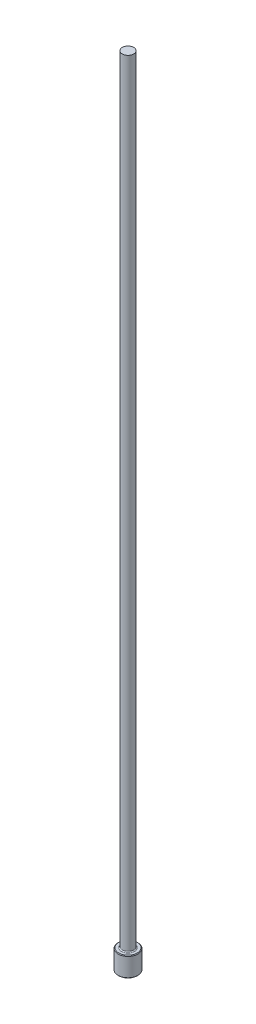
from build123d import *

# Parameters (mm, degrees)
CHAMFER1_SIZE = 0.0508
FILLET1_R     = 0.0762


with BuildPart() as part:
    # Sketch1 → Revolve1 (revolve)
    with BuildSketch(Plane.XY, mode=Mode.PRIVATE) as revolve1_sk:
        Polygon((0, 0), (-0.7874, 0), (-0.7874, 1.5748), (-0.4572, 1.5748), (-0.4572, 63.5), (0, 63.5), align=None)
    revolve(revolve1_sk.sketch.rotate(Axis((0, 259.958771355, 0), (0, -1, 0)), 270), axis=Axis((0, 259.958771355, 0), (0, -1, 0)))

    # Chamfer1
    chamfer1_edges = [part.edges().sort_by_distance(p)[0] for p in [
        (0, 1.5748, -0.7874),
        (0, 0, -0.7874),
    ]]
    chamfer(chamfer1_edges, length=CHAMFER1_SIZE)

    # Fillet1
    fillet1_edges = [part.edges().sort_by_distance(p)[0] for p in [
        (0, 1.5748, -0.4572),
    ]]
    fillet(fillet1_edges, radius=FILLET1_R)


solid = part.part
